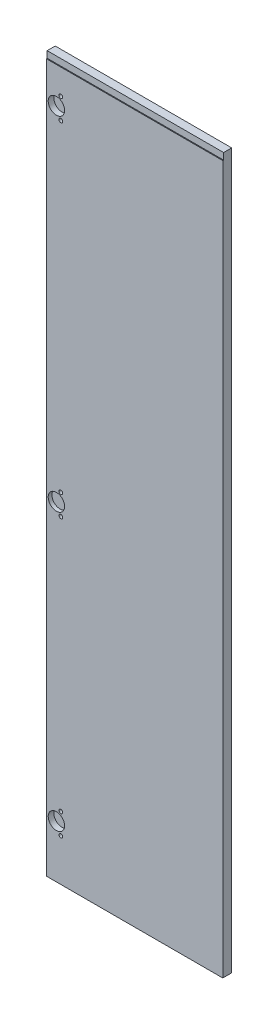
ISO-10303-21;
HEADER;
FILE_DESCRIPTION(('STEP AP214'),'2;1');
FILE_NAME('part.step','',(''),(''),'','','');
FILE_SCHEMA(('AUTOMOTIVE_DESIGN { 1 0 10303 214 1 1 1 1 }'));
ENDSEC;
DATA;
#1=APPLICATION_CONTEXT('core data for automotive mechanical design processes');
#2=APPLICATION_PROTOCOL_DEFINITION('international standard','automotive_design',2000,#1);
#3=PRODUCT_CONTEXT('',#1,'mechanical');
#4=PRODUCT('Part','Part','',(#3));
#5=PRODUCT_RELATED_PRODUCT_CATEGORY('part','',(#4));
#6=PRODUCT_DEFINITION_FORMATION('','',#4);
#7=PRODUCT_DEFINITION_CONTEXT('part definition',#1,'design');
#8=PRODUCT_DEFINITION('design','',#6,#7);
#9=PRODUCT_DEFINITION_SHAPE('','',#8);
#10=(LENGTH_UNIT() NAMED_UNIT(*) SI_UNIT(.MILLI.,.METRE.));
#11=(NAMED_UNIT(*) PLANE_ANGLE_UNIT() SI_UNIT($,.RADIAN.));
#12=(NAMED_UNIT(*) SI_UNIT($,.STERADIAN.) SOLID_ANGLE_UNIT());
#13=UNCERTAINTY_MEASURE_WITH_UNIT(LENGTH_MEASURE(1.E-05),#10,'distance_accuracy_value','');
#14=(GEOMETRIC_REPRESENTATION_CONTEXT(3) GLOBAL_UNCERTAINTY_ASSIGNED_CONTEXT((#13)) GLOBAL_UNIT_ASSIGNED_CONTEXT((#10,
#11,#12)) REPRESENTATION_CONTEXT('',''));
#15=CARTESIAN_POINT('',(0.,0.,0.));
#16=DIRECTION('',(0.,0.,1.));
#17=DIRECTION('',(1.,0.,0.));
#18=AXIS2_PLACEMENT_3D('',#15,#16,#17);
#19=CARTESIAN_POINT('',(188.25,-762.3,19.));
#20=DIRECTION('',(-1.,0.,0.));
#21=DIRECTION('',(0.,0.,1.));
#22=AXIS2_PLACEMENT_3D('',#19,#20,#21);
#23=PLANE('',#22);
#24=DIRECTION('',(0.,-1.,0.));
#25=VECTOR('',#24,1.);
#26=CARTESIAN_POINT('',(188.25,762.3,17.2));
#27=LINE('',#26,#25);
#28=CARTESIAN_POINT('',(188.25,762.3,17.2));
#29=VERTEX_POINT('',#28);
#30=CARTESIAN_POINT('',(188.25,748.3,17.2));
#31=VERTEX_POINT('',#30);
#32=EDGE_CURVE('E123',#29,#31,#27,.T.);
#33=ORIENTED_EDGE('',*,*,#32,.T.);
#34=DIRECTION('',(0.,0.,1.));
#35=VECTOR('',#34,1.);
#36=CARTESIAN_POINT('',(188.25,748.3,17.2));
#37=LINE('',#36,#35);
#38=CARTESIAN_POINT('',(188.25,748.3,19.));
#39=VERTEX_POINT('',#38);
#40=EDGE_CURVE('E176',#31,#39,#37,.T.);
#41=ORIENTED_EDGE('',*,*,#40,.T.);
#42=DIRECTION('',(0.,1.,0.));
#43=VECTOR('',#42,1.);
#44=CARTESIAN_POINT('',(188.25,-762.3,19.));
#45=LINE('',#44,#43);
#46=CARTESIAN_POINT('',(188.25,-762.3,19.));
#47=VERTEX_POINT('',#46);
#48=EDGE_CURVE('E83',#47,#39,#45,.T.);
#49=ORIENTED_EDGE('',*,*,#48,.F.);
#50=DIRECTION('',(0.,0.,-1.));
#51=VECTOR('',#50,1.);
#52=CARTESIAN_POINT('',(188.25,-762.3,19.));
#53=LINE('',#52,#51);
#54=CARTESIAN_POINT('',(188.25,-762.3,0.));
#55=VERTEX_POINT('',#54);
#56=EDGE_CURVE('E76',#47,#55,#53,.T.);
#57=ORIENTED_EDGE('',*,*,#56,.T.);
#58=DIRECTION('',(0.,1.,0.));
#59=VECTOR('',#58,1.);
#60=CARTESIAN_POINT('',(188.25,-762.3,0.));
#61=LINE('',#60,#59);
#62=CARTESIAN_POINT('',(188.25,762.3,0.));
#63=VERTEX_POINT('',#62);
#64=EDGE_CURVE('E90',#55,#63,#61,.T.);
#65=ORIENTED_EDGE('',*,*,#64,.T.);
#66=DIRECTION('',(0.,0.,-1.));
#67=VECTOR('',#66,1.);
#68=CARTESIAN_POINT('',(188.25,762.3,19.));
#69=LINE('',#68,#67);
#70=EDGE_CURVE('E11',#29,#63,#69,.T.);
#71=ORIENTED_EDGE('',*,*,#70,.F.);
#72=EDGE_LOOP('',(#33,#41,#49,#57,#65,#71));
#73=FACE_BOUND('',#72,.T.);
#74=ADVANCED_FACE('F32',(#73),#23,.F.);
#75=CARTESIAN_POINT('',(-188.25,762.3,19.));
#76=DIRECTION('',(0.,-1.,0.));
#77=DIRECTION('',(0.,0.,-1.));
#78=AXIS2_PLACEMENT_3D('',#75,#76,#77);
#79=PLANE('',#78);
#80=DIRECTION('',(0.,0.,-1.));
#81=VECTOR('',#80,1.);
#82=CARTESIAN_POINT('',(-188.25,762.3,19.));
#83=LINE('',#82,#81);
#84=CARTESIAN_POINT('',(-188.25,762.3,17.2));
#85=VERTEX_POINT('',#84);
#86=CARTESIAN_POINT('',(-188.25,762.3,0.));
#87=VERTEX_POINT('',#86);
#88=EDGE_CURVE('E39',#85,#87,#83,.T.);
#89=ORIENTED_EDGE('',*,*,#88,.F.);
#90=DIRECTION('',(-1.,0.,0.));
#91=VECTOR('',#90,1.);
#92=CARTESIAN_POINT('',(188.25,762.3,17.2));
#93=LINE('',#92,#91);
#94=EDGE_CURVE('E120',#29,#85,#93,.T.);
#95=ORIENTED_EDGE('',*,*,#94,.F.);
#96=ORIENTED_EDGE('',*,*,#70,.T.);
#97=DIRECTION('',(-1.,0.,0.));
#98=VECTOR('',#97,1.);
#99=CARTESIAN_POINT('',(-188.25,762.3,0.));
#100=LINE('',#99,#98);
#101=EDGE_CURVE('E96',#63,#87,#100,.T.);
#102=ORIENTED_EDGE('',*,*,#101,.T.);
#103=EDGE_LOOP('',(#89,#95,#96,#102));
#104=FACE_BOUND('',#103,.T.);
#105=ADVANCED_FACE('F117',(#104),#79,.F.);
#106=CARTESIAN_POINT('',(-188.25,-762.3,19.));
#107=DIRECTION('',(1.,0.,0.));
#108=DIRECTION('',(0.,0.,-1.));
#109=AXIS2_PLACEMENT_3D('',#106,#107,#108);
#110=PLANE('',#109);
#111=DIRECTION('',(0.,-1.,0.));
#112=VECTOR('',#111,1.);
#113=CARTESIAN_POINT('',(-188.25,-762.3,19.));
#114=LINE('',#113,#112);
#115=CARTESIAN_POINT('',(-188.25,748.3,19.));
#116=VERTEX_POINT('',#115);
#117=CARTESIAN_POINT('',(-188.25,-762.3,19.));
#118=VERTEX_POINT('',#117);
#119=EDGE_CURVE('E172',#116,#118,#114,.T.);
#120=ORIENTED_EDGE('',*,*,#119,.F.);
#121=DIRECTION('',(0.,0.,1.));
#122=VECTOR('',#121,1.);
#123=CARTESIAN_POINT('',(-188.25,748.3,17.2));
#124=LINE('',#123,#122);
#125=CARTESIAN_POINT('',(-188.25,748.3,17.2));
#126=VERTEX_POINT('',#125);
#127=EDGE_CURVE('E46',#126,#116,#124,.T.);
#128=ORIENTED_EDGE('',*,*,#127,.F.);
#129=DIRECTION('',(0.,-1.,0.));
#130=VECTOR('',#129,1.);
#131=CARTESIAN_POINT('',(-188.25,762.3,17.2));
#132=LINE('',#131,#130);
#133=EDGE_CURVE('E114',#85,#126,#132,.T.);
#134=ORIENTED_EDGE('',*,*,#133,.F.);
#135=ORIENTED_EDGE('',*,*,#88,.T.);
#136=DIRECTION('',(0.,-1.,0.));
#137=VECTOR('',#136,1.);
#138=CARTESIAN_POINT('',(-188.25,-762.3,0.));
#139=LINE('',#138,#137);
#140=CARTESIAN_POINT('',(-188.25,-762.3,0.));
#141=VERTEX_POINT('',#140);
#142=EDGE_CURVE('E84',#87,#141,#139,.T.);
#143=ORIENTED_EDGE('',*,*,#142,.T.);
#144=DIRECTION('',(0.,0.,-1.));
#145=VECTOR('',#144,1.);
#146=CARTESIAN_POINT('',(-188.25,-762.3,19.));
#147=LINE('',#146,#145);
#148=EDGE_CURVE('E79',#118,#141,#147,.T.);
#149=ORIENTED_EDGE('',*,*,#148,.F.);
#150=EDGE_LOOP('',(#120,#128,#134,#135,#143,#149));
#151=FACE_BOUND('',#150,.T.);
#152=ADVANCED_FACE('F111',(#151),#110,.F.);
#153=CARTESIAN_POINT('',(-188.25,-762.3,19.));
#154=DIRECTION('',(0.,1.,0.));
#155=DIRECTION('',(0.,0.,1.));
#156=AXIS2_PLACEMENT_3D('',#153,#154,#155);
#157=PLANE('',#156);
#158=DIRECTION('',(1.,0.,0.));
#159=VECTOR('',#158,1.);
#160=CARTESIAN_POINT('',(-188.25,-762.3,0.));
#161=LINE('',#160,#159);
#162=EDGE_CURVE('E73',#141,#55,#161,.T.);
#163=ORIENTED_EDGE('',*,*,#162,.T.);
#164=ORIENTED_EDGE('',*,*,#56,.F.);
#165=DIRECTION('',(1.,0.,0.));
#166=VECTOR('',#165,1.);
#167=CARTESIAN_POINT('',(-188.25,-762.3,19.));
#168=LINE('',#167,#166);
#169=EDGE_CURVE('E55',#118,#47,#168,.T.);
#170=ORIENTED_EDGE('',*,*,#169,.F.);
#171=ORIENTED_EDGE('',*,*,#148,.T.);
#172=EDGE_LOOP('',(#163,#164,#170,#171));
#173=FACE_BOUND('',#172,.T.);
#174=ADVANCED_FACE('F75',(#173),#157,.F.);
#175=CARTESIAN_POINT('',(0.,0.,19.));
#176=DIRECTION('',(0.,0.,-1.));
#177=DIRECTION('',(-1.,0.,0.));
#178=AXIS2_PLACEMENT_3D('',#175,#176,#177);
#179=PLANE('',#178);
#180=CARTESIAN_POINT('',(-157.25,-37.3,19.));
#181=DIRECTION('',(0.,0.,1.));
#182=DIRECTION('',(1.,0.,0.));
#183=AXIS2_PLACEMENT_3D('',#180,#181,#182);
#184=CIRCLE('',#183,4.);
#185=CARTESIAN_POINT('',(-153.25,-37.3,19.));
#186=VERTEX_POINT('',#185);
#187=EDGE_CURVE('E454',#186,#186,#184,.T.);
#188=ORIENTED_EDGE('',*,*,#187,.F.);
#189=EDGE_LOOP('',(#188));
#190=FACE_BOUND('',#189,.T.);
#191=CARTESIAN_POINT('',(-157.25,-82.3,19.));
#192=DIRECTION('',(0.,0.,1.));
#193=DIRECTION('',(1.,0.,0.));
#194=AXIS2_PLACEMENT_3D('',#191,#192,#193);
#195=CIRCLE('',#194,4.);
#196=CARTESIAN_POINT('',(-153.25,-82.3,19.));
#197=VERTEX_POINT('',#196);
#198=EDGE_CURVE('E456',#197,#197,#195,.T.);
#199=ORIENTED_EDGE('',*,*,#198,.F.);
#200=EDGE_LOOP('',(#199));
#201=FACE_BOUND('',#200,.T.);
#202=CARTESIAN_POINT('',(-166.75,-59.8,19.));
#203=DIRECTION('',(0.,0.,1.));
#204=DIRECTION('',(1.,0.,0.));
#205=AXIS2_PLACEMENT_3D('',#202,#203,#204);
#206=CIRCLE('',#205,17.5);
#207=CARTESIAN_POINT('',(-149.25,-59.8,19.));
#208=VERTEX_POINT('',#207);
#209=EDGE_CURVE('E464',#208,#208,#206,.T.);
#210=ORIENTED_EDGE('',*,*,#209,.F.);
#211=EDGE_LOOP('',(#210));
#212=FACE_BOUND('',#211,.T.);
#213=CARTESIAN_POINT('',(-157.25,694.5,19.));
#214=DIRECTION('',(0.,0.,1.));
#215=DIRECTION('',(1.,0.,0.));
#216=AXIS2_PLACEMENT_3D('',#213,#214,#215);
#217=CIRCLE('',#216,4.);
#218=CARTESIAN_POINT('',(-153.25,694.5,19.));
#219=VERTEX_POINT('',#218);
#220=EDGE_CURVE('E183',#219,#219,#217,.T.);
#221=ORIENTED_EDGE('',*,*,#220,.F.);
#222=EDGE_LOOP('',(#221));
#223=FACE_BOUND('',#222,.T.);
#224=CARTESIAN_POINT('',(-157.25,649.5,19.));
#225=DIRECTION('',(0.,0.,1.));
#226=DIRECTION('',(1.,0.,0.));
#227=AXIS2_PLACEMENT_3D('',#224,#225,#226);
#228=CIRCLE('',#227,4.);
#229=CARTESIAN_POINT('',(-153.25,649.5,19.));
#230=VERTEX_POINT('',#229);
#231=EDGE_CURVE('E192',#230,#230,#228,.T.);
#232=ORIENTED_EDGE('',*,*,#231,.F.);
#233=EDGE_LOOP('',(#232));
#234=FACE_BOUND('',#233,.T.);
#235=CARTESIAN_POINT('',(-157.25,-627.3,19.));
#236=DIRECTION('',(0.,0.,1.));
#237=DIRECTION('',(1.,0.,0.));
#238=AXIS2_PLACEMENT_3D('',#235,#236,#237);
#239=CIRCLE('',#238,4.);
#240=CARTESIAN_POINT('',(-153.25,-627.3,19.));
#241=VERTEX_POINT('',#240);
#242=EDGE_CURVE('E198',#241,#241,#239,.T.);
#243=ORIENTED_EDGE('',*,*,#242,.F.);
#244=EDGE_LOOP('',(#243));
#245=FACE_BOUND('',#244,.T.);
#246=CARTESIAN_POINT('',(-157.25,-672.3,19.));
#247=DIRECTION('',(0.,0.,1.));
#248=DIRECTION('',(1.,0.,0.));
#249=AXIS2_PLACEMENT_3D('',#246,#247,#248);
#250=CIRCLE('',#249,4.);
#251=CARTESIAN_POINT('',(-153.25,-672.3,19.));
#252=VERTEX_POINT('',#251);
#253=EDGE_CURVE('E158',#252,#252,#250,.T.);
#254=ORIENTED_EDGE('',*,*,#253,.F.);
#255=EDGE_LOOP('',(#254));
#256=FACE_BOUND('',#255,.T.);
#257=CARTESIAN_POINT('',(-166.75,-649.8,19.));
#258=DIRECTION('',(0.,0.,1.));
#259=DIRECTION('',(1.,0.,0.));
#260=AXIS2_PLACEMENT_3D('',#257,#258,#259);
#261=CIRCLE('',#260,17.5);
#262=CARTESIAN_POINT('',(-149.25,-649.8,19.));
#263=VERTEX_POINT('',#262);
#264=EDGE_CURVE('E157',#263,#263,#261,.T.);
#265=ORIENTED_EDGE('',*,*,#264,.F.);
#266=EDGE_LOOP('',(#265));
#267=FACE_BOUND('',#266,.T.);
#268=CARTESIAN_POINT('',(-166.75,672.,19.));
#269=DIRECTION('',(0.,0.,1.));
#270=DIRECTION('',(1.,0.,0.));
#271=AXIS2_PLACEMENT_3D('',#268,#269,#270);
#272=CIRCLE('',#271,17.5);
#273=CARTESIAN_POINT('',(-149.25,672.,19.));
#274=VERTEX_POINT('',#273);
#275=EDGE_CURVE('E101',#274,#274,#272,.T.);
#276=ORIENTED_EDGE('',*,*,#275,.F.);
#277=EDGE_LOOP('',(#276));
#278=FACE_BOUND('',#277,.T.);
#279=ORIENTED_EDGE('',*,*,#48,.T.);
#280=DIRECTION('',(-1.,0.,0.));
#281=VECTOR('',#280,1.);
#282=CARTESIAN_POINT('',(188.25,748.3,19.));
#283=LINE('',#282,#281);
#284=EDGE_CURVE('E174',#39,#116,#283,.T.);
#285=ORIENTED_EDGE('',*,*,#284,.T.);
#286=ORIENTED_EDGE('',*,*,#119,.T.);
#287=ORIENTED_EDGE('',*,*,#169,.T.);
#288=EDGE_LOOP('',(#279,#285,#286,#287));
#289=FACE_BOUND('',#288,.T.);
#290=ADVANCED_FACE('F173',(#190,#201,#212,#223,#234,#245,#256,#267,#278,#289),#179,.F.);
#291=CARTESIAN_POINT('',(0.,0.,0.));
#292=DIRECTION('',(0.,0.,-1.));
#293=DIRECTION('',(-1.,0.,0.));
#294=AXIS2_PLACEMENT_3D('',#291,#292,#293);
#295=PLANE('',#294);
#296=ORIENTED_EDGE('',*,*,#64,.F.);
#297=ORIENTED_EDGE('',*,*,#162,.F.);
#298=ORIENTED_EDGE('',*,*,#142,.F.);
#299=ORIENTED_EDGE('',*,*,#101,.F.);
#300=EDGE_LOOP('',(#296,#297,#298,#299));
#301=FACE_BOUND('',#300,.T.);
#302=ADVANCED_FACE('F94',(#301),#295,.T.);
#303=CARTESIAN_POINT('',(-166.75,672.,7.));
#304=DIRECTION('',(0.,0.,1.));
#305=DIRECTION('',(1.,0.,0.));
#306=AXIS2_PLACEMENT_3D('',#303,#304,#305);
#307=CYLINDRICAL_SURFACE('',#306,17.5);
#308=CARTESIAN_POINT('',(-166.75,672.,7.));
#309=DIRECTION('',(0.,0.,1.));
#310=DIRECTION('',(1.,0.,0.));
#311=AXIS2_PLACEMENT_3D('',#308,#309,#310);
#312=CIRCLE('',#311,17.5);
#313=CARTESIAN_POINT('',(-149.25,672.,7.));
#314=VERTEX_POINT('',#313);
#315=EDGE_CURVE('E97',#314,#314,#312,.T.);
#316=ORIENTED_EDGE('',*,*,#315,.F.);
#317=EDGE_LOOP('',(#316));
#318=FACE_BOUND('',#317,.T.);
#319=ORIENTED_EDGE('',*,*,#275,.T.);
#320=EDGE_LOOP('',(#319));
#321=FACE_BOUND('',#320,.T.);
#322=ADVANCED_FACE('F222',(#318,#321),#307,.F.);
#323=CARTESIAN_POINT('',(-166.75,672.,7.));
#324=DIRECTION('',(0.,0.,1.));
#325=DIRECTION('',(1.,0.,0.));
#326=AXIS2_PLACEMENT_3D('',#323,#324,#325);
#327=PLANE('',#326);
#328=ORIENTED_EDGE('',*,*,#315,.T.);
#329=EDGE_LOOP('',(#328));
#330=FACE_BOUND('',#329,.T.);
#331=ADVANCED_FACE('F224',(#330),#327,.T.);
#332=CARTESIAN_POINT('',(-166.75,-649.8,7.));
#333=DIRECTION('',(0.,0.,1.));
#334=DIRECTION('',(1.,0.,0.));
#335=AXIS2_PLACEMENT_3D('',#332,#333,#334);
#336=CYLINDRICAL_SURFACE('',#335,17.5);
#337=CARTESIAN_POINT('',(-166.75,-649.8,7.));
#338=DIRECTION('',(0.,0.,1.));
#339=DIRECTION('',(1.,0.,0.));
#340=AXIS2_PLACEMENT_3D('',#337,#338,#339);
#341=CIRCLE('',#340,17.5);
#342=CARTESIAN_POINT('',(-149.25,-649.8,7.));
#343=VERTEX_POINT('',#342);
#344=EDGE_CURVE('E161',#343,#343,#341,.T.);
#345=ORIENTED_EDGE('',*,*,#344,.F.);
#346=EDGE_LOOP('',(#345));
#347=FACE_BOUND('',#346,.T.);
#348=ORIENTED_EDGE('',*,*,#264,.T.);
#349=EDGE_LOOP('',(#348));
#350=FACE_BOUND('',#349,.T.);
#351=ADVANCED_FACE('F231',(#347,#350),#336,.F.);
#352=CARTESIAN_POINT('',(-166.75,-649.8,7.));
#353=DIRECTION('',(0.,0.,1.));
#354=DIRECTION('',(1.,0.,0.));
#355=AXIS2_PLACEMENT_3D('',#352,#353,#354);
#356=PLANE('',#355);
#357=ORIENTED_EDGE('',*,*,#344,.T.);
#358=EDGE_LOOP('',(#357));
#359=FACE_BOUND('',#358,.T.);
#360=ADVANCED_FACE('F151',(#359),#356,.T.);
#361=CARTESIAN_POINT('',(-157.25,-672.3,12.));
#362=DIRECTION('',(0.,0.,1.));
#363=DIRECTION('',(1.,0.,0.));
#364=AXIS2_PLACEMENT_3D('',#361,#362,#363);
#365=CONICAL_SURFACE('',#364,4.,1.02974425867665);
#366=CARTESIAN_POINT('',(-157.25,-672.3,9.59655752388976));
#367=VERTEX_POINT('',#366);
#368=VERTEX_LOOP('',#367);
#369=FACE_BOUND('',#368,.T.);
#370=CARTESIAN_POINT('',(-157.25,-672.3,12.));
#371=DIRECTION('',(0.,0.,1.));
#372=DIRECTION('',(1.,0.,0.));
#373=AXIS2_PLACEMENT_3D('',#370,#371,#372);
#374=CIRCLE('',#373,4.);
#375=CARTESIAN_POINT('',(-153.25,-672.3,12.));
#376=VERTEX_POINT('',#375);
#377=EDGE_CURVE('E155',#376,#376,#374,.T.);
#378=ORIENTED_EDGE('',*,*,#377,.T.);
#379=EDGE_LOOP('',(#378));
#380=FACE_BOUND('',#379,.T.);
#381=ADVANCED_FACE('F147',(#369,#380),#365,.F.);
#382=CARTESIAN_POINT('',(-157.25,-672.3,19.));
#383=DIRECTION('',(0.,0.,1.));
#384=DIRECTION('',(1.,0.,0.));
#385=AXIS2_PLACEMENT_3D('',#382,#383,#384);
#386=CYLINDRICAL_SURFACE('',#385,4.);
#387=ORIENTED_EDGE('',*,*,#377,.F.);
#388=EDGE_LOOP('',(#387));
#389=FACE_BOUND('',#388,.T.);
#390=ORIENTED_EDGE('',*,*,#253,.T.);
#391=EDGE_LOOP('',(#390));
#392=FACE_BOUND('',#391,.T.);
#393=ADVANCED_FACE('F150',(#389,#392),#386,.F.);
#394=CARTESIAN_POINT('',(-157.25,-627.3,12.));
#395=DIRECTION('',(0.,0.,1.));
#396=DIRECTION('',(1.,0.,0.));
#397=AXIS2_PLACEMENT_3D('',#394,#395,#396);
#398=CONICAL_SURFACE('',#397,4.,1.02974425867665);
#399=CARTESIAN_POINT('',(-157.25,-627.3,9.59655752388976));
#400=VERTEX_POINT('',#399);
#401=VERTEX_LOOP('',#400);
#402=FACE_BOUND('',#401,.T.);
#403=CARTESIAN_POINT('',(-157.25,-627.3,12.));
#404=DIRECTION('',(0.,0.,1.));
#405=DIRECTION('',(1.,0.,0.));
#406=AXIS2_PLACEMENT_3D('',#403,#404,#405);
#407=CIRCLE('',#406,4.);
#408=CARTESIAN_POINT('',(-153.25,-627.3,12.));
#409=VERTEX_POINT('',#408);
#410=EDGE_CURVE('E164',#409,#409,#407,.T.);
#411=ORIENTED_EDGE('',*,*,#410,.T.);
#412=EDGE_LOOP('',(#411));
#413=FACE_BOUND('',#412,.T.);
#414=ADVANCED_FACE('F203',(#402,#413),#398,.F.);
#415=CARTESIAN_POINT('',(-157.25,-627.3,19.));
#416=DIRECTION('',(0.,0.,1.));
#417=DIRECTION('',(1.,0.,0.));
#418=AXIS2_PLACEMENT_3D('',#415,#416,#417);
#419=CYLINDRICAL_SURFACE('',#418,4.);
#420=ORIENTED_EDGE('',*,*,#410,.F.);
#421=EDGE_LOOP('',(#420));
#422=FACE_BOUND('',#421,.T.);
#423=ORIENTED_EDGE('',*,*,#242,.T.);
#424=EDGE_LOOP('',(#423));
#425=FACE_BOUND('',#424,.T.);
#426=ADVANCED_FACE('F205',(#422,#425),#419,.F.);
#427=CARTESIAN_POINT('',(-157.25,649.5,12.));
#428=DIRECTION('',(0.,0.,1.));
#429=DIRECTION('',(1.,0.,0.));
#430=AXIS2_PLACEMENT_3D('',#427,#428,#429);
#431=CONICAL_SURFACE('',#430,4.,1.02974425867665);
#432=CARTESIAN_POINT('',(-157.25,649.5,9.59655752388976));
#433=VERTEX_POINT('',#432);
#434=VERTEX_LOOP('',#433);
#435=FACE_BOUND('',#434,.T.);
#436=CARTESIAN_POINT('',(-157.25,649.5,12.));
#437=DIRECTION('',(0.,0.,1.));
#438=DIRECTION('',(1.,0.,0.));
#439=AXIS2_PLACEMENT_3D('',#436,#437,#438);
#440=CIRCLE('',#439,4.);
#441=CARTESIAN_POINT('',(-153.25,649.5,12.));
#442=VERTEX_POINT('',#441);
#443=EDGE_CURVE('E195',#442,#442,#440,.T.);
#444=ORIENTED_EDGE('',*,*,#443,.T.);
#445=EDGE_LOOP('',(#444));
#446=FACE_BOUND('',#445,.T.);
#447=ADVANCED_FACE('F208',(#435,#446),#431,.F.);
#448=CARTESIAN_POINT('',(-157.25,649.5,19.));
#449=DIRECTION('',(0.,0.,1.));
#450=DIRECTION('',(1.,0.,0.));
#451=AXIS2_PLACEMENT_3D('',#448,#449,#450);
#452=CYLINDRICAL_SURFACE('',#451,4.);
#453=ORIENTED_EDGE('',*,*,#443,.F.);
#454=EDGE_LOOP('',(#453));
#455=FACE_BOUND('',#454,.T.);
#456=ORIENTED_EDGE('',*,*,#231,.T.);
#457=EDGE_LOOP('',(#456));
#458=FACE_BOUND('',#457,.T.);
#459=ADVANCED_FACE('F326',(#455,#458),#452,.F.);
#460=CARTESIAN_POINT('',(-157.25,694.5,12.));
#461=DIRECTION('',(0.,0.,1.));
#462=DIRECTION('',(1.,0.,0.));
#463=AXIS2_PLACEMENT_3D('',#460,#461,#462);
#464=CONICAL_SURFACE('',#463,4.,1.02974425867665);
#465=CARTESIAN_POINT('',(-157.25,694.5,9.59655752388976));
#466=VERTEX_POINT('',#465);
#467=VERTEX_LOOP('',#466);
#468=FACE_BOUND('',#467,.T.);
#469=CARTESIAN_POINT('',(-157.25,694.5,12.));
#470=DIRECTION('',(0.,0.,1.));
#471=DIRECTION('',(1.,0.,0.));
#472=AXIS2_PLACEMENT_3D('',#469,#470,#471);
#473=CIRCLE('',#472,4.);
#474=CARTESIAN_POINT('',(-153.25,694.5,12.));
#475=VERTEX_POINT('',#474);
#476=EDGE_CURVE('E189',#475,#475,#473,.T.);
#477=ORIENTED_EDGE('',*,*,#476,.T.);
#478=EDGE_LOOP('',(#477));
#479=FACE_BOUND('',#478,.T.);
#480=ADVANCED_FACE('F336',(#468,#479),#464,.F.);
#481=CARTESIAN_POINT('',(-157.25,694.5,19.));
#482=DIRECTION('',(0.,0.,1.));
#483=DIRECTION('',(1.,0.,0.));
#484=AXIS2_PLACEMENT_3D('',#481,#482,#483);
#485=CYLINDRICAL_SURFACE('',#484,4.);
#486=ORIENTED_EDGE('',*,*,#476,.F.);
#487=EDGE_LOOP('',(#486));
#488=FACE_BOUND('',#487,.T.);
#489=ORIENTED_EDGE('',*,*,#220,.T.);
#490=EDGE_LOOP('',(#489));
#491=FACE_BOUND('',#490,.T.);
#492=ADVANCED_FACE('F346',(#488,#491),#485,.F.);
#493=CARTESIAN_POINT('',(188.25,748.3,17.2));
#494=DIRECTION('',(0.,-1.,0.));
#495=DIRECTION('',(0.,0.,-1.));
#496=AXIS2_PLACEMENT_3D('',#493,#494,#495);
#497=PLANE('',#496);
#498=ORIENTED_EDGE('',*,*,#127,.T.);
#499=ORIENTED_EDGE('',*,*,#284,.F.);
#500=ORIENTED_EDGE('',*,*,#40,.F.);
#501=DIRECTION('',(-1.,0.,0.));
#502=VECTOR('',#501,1.);
#503=CARTESIAN_POINT('',(188.25,748.3,17.2));
#504=LINE('',#503,#502);
#505=EDGE_CURVE('E184',#31,#126,#504,.T.);
#506=ORIENTED_EDGE('',*,*,#505,.T.);
#507=EDGE_LOOP('',(#498,#499,#500,#506));
#508=FACE_BOUND('',#507,.T.);
#509=ADVANCED_FACE('F355',(#508),#497,.F.);
#510=CARTESIAN_POINT('',(188.25,762.3,17.2));
#511=DIRECTION('',(0.,0.,-1.));
#512=DIRECTION('',(-1.,0.,0.));
#513=AXIS2_PLACEMENT_3D('',#510,#511,#512);
#514=PLANE('',#513);
#515=ORIENTED_EDGE('',*,*,#133,.T.);
#516=ORIENTED_EDGE('',*,*,#505,.F.);
#517=ORIENTED_EDGE('',*,*,#32,.F.);
#518=ORIENTED_EDGE('',*,*,#94,.T.);
#519=EDGE_LOOP('',(#515,#516,#517,#518));
#520=FACE_BOUND('',#519,.T.);
#521=ADVANCED_FACE('F378',(#520),#514,.F.);
#522=CARTESIAN_POINT('',(-166.75,-59.8,11.));
#523=DIRECTION('',(0.,0.,1.));
#524=DIRECTION('',(1.,0.,0.));
#525=AXIS2_PLACEMENT_3D('',#522,#523,#524);
#526=CYLINDRICAL_SURFACE('',#525,17.5);
#527=CARTESIAN_POINT('',(-166.75,-59.8,11.));
#528=DIRECTION('',(0.,0.,1.));
#529=DIRECTION('',(1.,0.,0.));
#530=AXIS2_PLACEMENT_3D('',#527,#528,#529);
#531=CIRCLE('',#530,17.5);
#532=CARTESIAN_POINT('',(-149.25,-59.8,11.));
#533=VERTEX_POINT('',#532);
#534=EDGE_CURVE('E178',#533,#533,#531,.T.);
#535=ORIENTED_EDGE('',*,*,#534,.F.);
#536=EDGE_LOOP('',(#535));
#537=FACE_BOUND('',#536,.T.);
#538=ORIENTED_EDGE('',*,*,#209,.T.);
#539=EDGE_LOOP('',(#538));
#540=FACE_BOUND('',#539,.T.);
#541=ADVANCED_FACE('F387',(#537,#540),#526,.F.);
#542=CARTESIAN_POINT('',(-166.75,-59.8,11.));
#543=DIRECTION('',(0.,0.,1.));
#544=DIRECTION('',(1.,0.,0.));
#545=AXIS2_PLACEMENT_3D('',#542,#543,#544);
#546=PLANE('',#545);
#547=ORIENTED_EDGE('',*,*,#534,.T.);
#548=EDGE_LOOP('',(#547));
#549=FACE_BOUND('',#548,.T.);
#550=ADVANCED_FACE('F395',(#549),#546,.T.);
#551=CARTESIAN_POINT('',(-157.25,-82.3,12.));
#552=DIRECTION('',(0.,0.,1.));
#553=DIRECTION('',(1.,0.,0.));
#554=AXIS2_PLACEMENT_3D('',#551,#552,#553);
#555=CONICAL_SURFACE('',#554,3.99999999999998,1.02974425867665);
#556=CARTESIAN_POINT('',(-157.25,-82.3,9.59655752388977));
#557=VERTEX_POINT('',#556);
#558=VERTEX_LOOP('',#557);
#559=FACE_BOUND('',#558,.T.);
#560=CARTESIAN_POINT('',(-157.25,-82.3,12.));
#561=DIRECTION('',(0.,0.,1.));
#562=DIRECTION('',(1.,0.,0.));
#563=AXIS2_PLACEMENT_3D('',#560,#561,#562);
#564=CIRCLE('',#563,3.99999999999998);
#565=CARTESIAN_POINT('',(-153.25,-82.3,12.));
#566=VERTEX_POINT('',#565);
#567=EDGE_CURVE('E461',#566,#566,#564,.T.);
#568=ORIENTED_EDGE('',*,*,#567,.T.);
#569=EDGE_LOOP('',(#568));
#570=FACE_BOUND('',#569,.T.);
#571=ADVANCED_FACE('F404',(#559,#570),#555,.F.);
#572=CARTESIAN_POINT('',(-157.25,-82.3,19.));
#573=DIRECTION('',(0.,0.,1.));
#574=DIRECTION('',(1.,0.,0.));
#575=AXIS2_PLACEMENT_3D('',#572,#573,#574);
#576=CYLINDRICAL_SURFACE('',#575,3.99999999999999);
#577=ORIENTED_EDGE('',*,*,#567,.F.);
#578=EDGE_LOOP('',(#577));
#579=FACE_BOUND('',#578,.T.);
#580=ORIENTED_EDGE('',*,*,#198,.T.);
#581=EDGE_LOOP('',(#580));
#582=FACE_BOUND('',#581,.T.);
#583=ADVANCED_FACE('F414',(#579,#582),#576,.F.);
#584=CARTESIAN_POINT('',(-157.25,-37.3,12.));
#585=DIRECTION('',(0.,0.,1.));
#586=DIRECTION('',(1.,0.,0.));
#587=AXIS2_PLACEMENT_3D('',#584,#585,#586);
#588=CONICAL_SURFACE('',#587,3.99999999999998,1.02974425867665);
#589=CARTESIAN_POINT('',(-157.25,-37.3,9.59655752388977));
#590=VERTEX_POINT('',#589);
#591=VERTEX_LOOP('',#590);
#592=FACE_BOUND('',#591,.T.);
#593=CARTESIAN_POINT('',(-157.25,-37.3,12.));
#594=DIRECTION('',(0.,0.,1.));
#595=DIRECTION('',(1.,0.,0.));
#596=AXIS2_PLACEMENT_3D('',#593,#594,#595);
#597=CIRCLE('',#596,3.99999999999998);
#598=CARTESIAN_POINT('',(-153.25,-37.3,12.));
#599=VERTEX_POINT('',#598);
#600=EDGE_CURVE('E451',#599,#599,#597,.T.);
#601=ORIENTED_EDGE('',*,*,#600,.T.);
#602=EDGE_LOOP('',(#601));
#603=FACE_BOUND('',#602,.T.);
#604=ADVANCED_FACE('F421',(#592,#603),#588,.F.);
#605=CARTESIAN_POINT('',(-157.25,-37.3,19.));
#606=DIRECTION('',(0.,0.,1.));
#607=DIRECTION('',(1.,0.,0.));
#608=AXIS2_PLACEMENT_3D('',#605,#606,#607);
#609=CYLINDRICAL_SURFACE('',#608,3.99999999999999);
#610=ORIENTED_EDGE('',*,*,#600,.F.);
#611=EDGE_LOOP('',(#610));
#612=FACE_BOUND('',#611,.T.);
#613=ORIENTED_EDGE('',*,*,#187,.T.);
#614=EDGE_LOOP('',(#613));
#615=FACE_BOUND('',#614,.T.);
#616=ADVANCED_FACE('F429',(#612,#615),#609,.F.);
#617=CLOSED_SHELL('',(#74,#105,#152,#174,#290,#302,#322,#331,#351,#360,#381,#393,#414,#426,#447,
#459,#480,#492,#509,#521,#541,#550,#571,#583,#604,#616));
#618=MANIFOLD_SOLID_BREP('B2',#617);
#619=ADVANCED_BREP_SHAPE_REPRESENTATION('',(#18,#618),#14);
#620=SHAPE_DEFINITION_REPRESENTATION(#9,#619);
ENDSEC;
END-ISO-10303-21;
